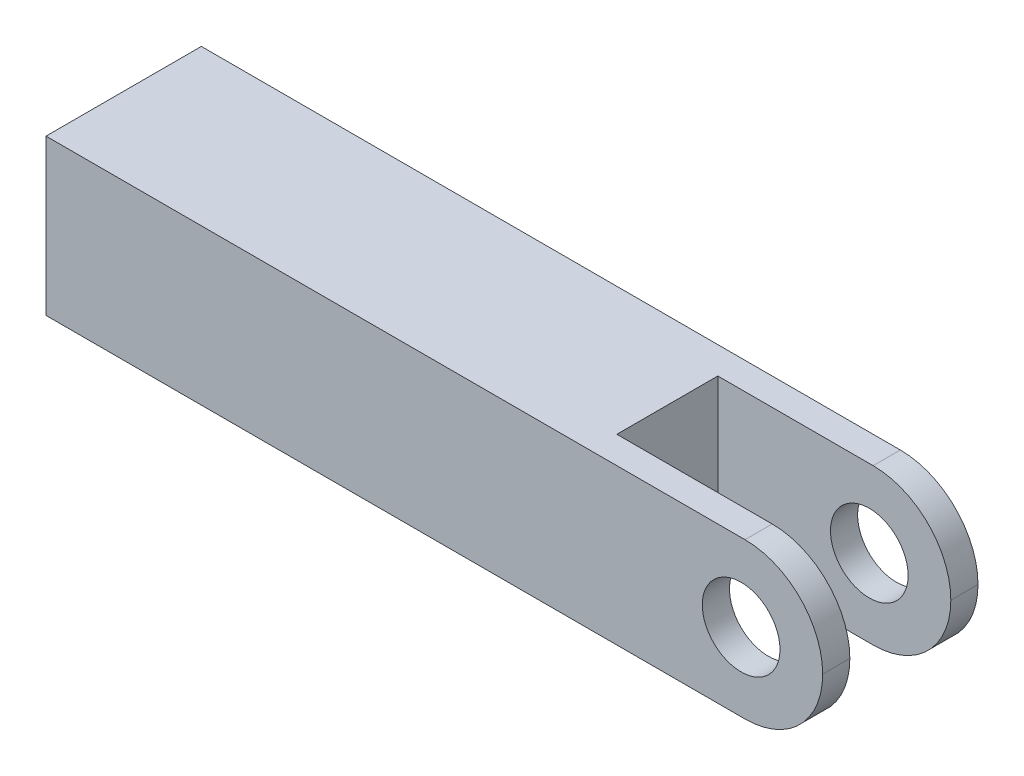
ISO-10303-21;
HEADER;
FILE_DESCRIPTION(('STEP AP214'),'2;1');
FILE_NAME('part.step','',(''),(''),'','','');
FILE_SCHEMA(('AUTOMOTIVE_DESIGN { 1 0 10303 214 1 1 1 1 }'));
ENDSEC;
DATA;
#1=APPLICATION_CONTEXT('core data for automotive mechanical design processes');
#2=APPLICATION_PROTOCOL_DEFINITION('international standard','automotive_design',2000,#1);
#3=PRODUCT_CONTEXT('',#1,'mechanical');
#4=PRODUCT('Part','Part','',(#3));
#5=PRODUCT_RELATED_PRODUCT_CATEGORY('part','',(#4));
#6=PRODUCT_DEFINITION_FORMATION('','',#4);
#7=PRODUCT_DEFINITION_CONTEXT('part definition',#1,'design');
#8=PRODUCT_DEFINITION('design','',#6,#7);
#9=PRODUCT_DEFINITION_SHAPE('','',#8);
#10=(LENGTH_UNIT() NAMED_UNIT(*) SI_UNIT(.MILLI.,.METRE.));
#11=(NAMED_UNIT(*) PLANE_ANGLE_UNIT() SI_UNIT($,.RADIAN.));
#12=(NAMED_UNIT(*) SI_UNIT($,.STERADIAN.) SOLID_ANGLE_UNIT());
#13=UNCERTAINTY_MEASURE_WITH_UNIT(LENGTH_MEASURE(1.E-05),#10,'distance_accuracy_value','');
#14=(GEOMETRIC_REPRESENTATION_CONTEXT(3) GLOBAL_UNCERTAINTY_ASSIGNED_CONTEXT((#13)) GLOBAL_UNIT_ASSIGNED_CONTEXT((#10,
#11,#12)) REPRESENTATION_CONTEXT('',''));
#15=CARTESIAN_POINT('',(0.,0.,0.));
#16=DIRECTION('',(0.,0.,1.));
#17=DIRECTION('',(1.,0.,0.));
#18=AXIS2_PLACEMENT_3D('',#15,#16,#17);
#19=CARTESIAN_POINT('',(79.9999999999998,0.,20.));
#20=DIRECTION('',(0.,0.,-0.999999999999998));
#21=DIRECTION('',(-0.999999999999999,0.,0.));
#22=AXIS2_PLACEMENT_3D('',#19,#20,#21);
#23=CYLINDRICAL_SURFACE('',#22,20.);
#24=CARTESIAN_POINT('',(79.9999999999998,0.,13.));
#25=DIRECTION('',(0.,0.,0.999999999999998));
#26=DIRECTION('',(0.999999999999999,0.,0.));
#27=AXIS2_PLACEMENT_3D('',#24,#25,#26);
#28=CIRCLE('',#27,20.);
#29=CARTESIAN_POINT('',(79.9999999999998,20.0000000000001,13.));
#30=VERTEX_POINT('',#29);
#31=CARTESIAN_POINT('',(99.9999999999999,0.,13.));
#32=VERTEX_POINT('',#31);
#33=EDGE_CURVE('E147',#30,#32,#28,.F.);
#34=ORIENTED_EDGE('',*,*,#33,.F.);
#35=DIRECTION('',(0.,0.,-0.999999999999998));
#36=VECTOR('',#35,1.);
#37=CARTESIAN_POINT('',(79.9999999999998,20.,20.));
#38=LINE('',#37,#36);
#39=CARTESIAN_POINT('',(79.9999999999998,20.,20.));
#40=VERTEX_POINT('',#39);
#41=EDGE_CURVE('E187',#40,#30,#38,.T.);
#42=ORIENTED_EDGE('',*,*,#41,.F.);
#43=CARTESIAN_POINT('',(79.9999999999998,0.,20.));
#44=DIRECTION('',(0.,0.,-0.999999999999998));
#45=DIRECTION('',(-0.999999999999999,0.,0.));
#46=AXIS2_PLACEMENT_3D('',#43,#44,#45);
#47=CIRCLE('',#46,20.);
#48=CARTESIAN_POINT('',(99.9999999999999,0.,20.));
#49=VERTEX_POINT('',#48);
#50=EDGE_CURVE('E60',#49,#40,#47,.F.);
#51=ORIENTED_EDGE('',*,*,#50,.F.);
#52=DIRECTION('',(0.,0.,-0.999999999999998));
#53=VECTOR('',#52,1.);
#54=CARTESIAN_POINT('',(99.9999999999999,0.,20.));
#55=LINE('',#54,#53);
#56=EDGE_CURVE('E149',#32,#49,#55,.F.);
#57=ORIENTED_EDGE('',*,*,#56,.F.);
#58=EDGE_LOOP('',(#34,#42,#51,#57));
#59=FACE_BOUND('',#58,.T.);
#60=ADVANCED_FACE('F36',(#59),#23,.T.);
#61=CARTESIAN_POINT('',(79.9999999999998,0.,20.));
#62=DIRECTION('',(0.,0.,-0.999999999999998));
#63=DIRECTION('',(-0.999999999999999,0.,0.));
#64=AXIS2_PLACEMENT_3D('',#61,#62,#63);
#65=CYLINDRICAL_SURFACE('',#64,20.);
#66=CARTESIAN_POINT('',(79.9999999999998,0.,13.));
#67=DIRECTION('',(0.,0.,0.999999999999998));
#68=DIRECTION('',(0.999999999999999,0.,0.));
#69=AXIS2_PLACEMENT_3D('',#66,#67,#68);
#70=CIRCLE('',#69,20.);
#71=CARTESIAN_POINT('',(79.9999999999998,-19.9999999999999,13.));
#72=VERTEX_POINT('',#71);
#73=EDGE_CURVE('E11',#32,#72,#70,.F.);
#74=ORIENTED_EDGE('',*,*,#73,.F.);
#75=ORIENTED_EDGE('',*,*,#56,.T.);
#76=CARTESIAN_POINT('',(79.9999999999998,0.,20.));
#77=DIRECTION('',(0.,0.,-0.999999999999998));
#78=DIRECTION('',(-0.999999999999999,0.,0.));
#79=AXIS2_PLACEMENT_3D('',#76,#77,#78);
#80=CIRCLE('',#79,20.);
#81=CARTESIAN_POINT('',(79.9999999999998,-20.,20.));
#82=VERTEX_POINT('',#81);
#83=EDGE_CURVE('E184',#82,#49,#80,.F.);
#84=ORIENTED_EDGE('',*,*,#83,.F.);
#85=DIRECTION('',(0.,0.,-0.999999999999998));
#86=VECTOR('',#85,1.);
#87=CARTESIAN_POINT('',(79.9999999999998,-20.,20.));
#88=LINE('',#87,#86);
#89=EDGE_CURVE('E179',#72,#82,#88,.F.);
#90=ORIENTED_EDGE('',*,*,#89,.F.);
#91=EDGE_LOOP('',(#74,#75,#84,#90));
#92=FACE_BOUND('',#91,.T.);
#93=ADVANCED_FACE('F219',(#92),#65,.T.);
#94=CARTESIAN_POINT('',(-99.9999999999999,-19.9999999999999,20.));
#95=DIRECTION('',(0.999999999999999,0.,0.));
#96=DIRECTION('',(0.,0.,-0.999999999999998));
#97=AXIS2_PLACEMENT_3D('',#94,#95,#96);
#98=PLANE('',#97);
#99=DIRECTION('',(0.,-0.999999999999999,0.));
#100=VECTOR('',#99,1.);
#101=CARTESIAN_POINT('',(-99.9999999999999,-19.9999999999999,-20.));
#102=LINE('',#101,#100);
#103=CARTESIAN_POINT('',(-99.9999999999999,20.,-20.));
#104=VERTEX_POINT('',#103);
#105=CARTESIAN_POINT('',(-99.9999999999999,-19.9999999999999,-20.));
#106=VERTEX_POINT('',#105);
#107=EDGE_CURVE('E153',#104,#106,#102,.T.);
#108=ORIENTED_EDGE('',*,*,#107,.T.);
#109=DIRECTION('',(0.,0.,-0.999999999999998));
#110=VECTOR('',#109,1.);
#111=CARTESIAN_POINT('',(-99.9999999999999,-19.9999999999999,20.));
#112=LINE('',#111,#110);
#113=CARTESIAN_POINT('',(-99.9999999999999,-19.9999999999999,20.));
#114=VERTEX_POINT('',#113);
#115=EDGE_CURVE('E172',#114,#106,#112,.T.);
#116=ORIENTED_EDGE('',*,*,#115,.F.);
#117=DIRECTION('',(0.,-0.999999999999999,0.));
#118=VECTOR('',#117,1.);
#119=CARTESIAN_POINT('',(-99.9999999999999,-19.9999999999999,20.));
#120=LINE('',#119,#118);
#121=CARTESIAN_POINT('',(-99.9999999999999,20.,20.));
#122=VERTEX_POINT('',#121);
#123=EDGE_CURVE('E161',#122,#114,#120,.T.);
#124=ORIENTED_EDGE('',*,*,#123,.F.);
#125=DIRECTION('',(0.,0.,-0.999999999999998));
#126=VECTOR('',#125,1.);
#127=CARTESIAN_POINT('',(-99.9999999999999,20.,20.));
#128=LINE('',#127,#126);
#129=EDGE_CURVE('E169',#122,#104,#128,.T.);
#130=ORIENTED_EDGE('',*,*,#129,.T.);
#131=EDGE_LOOP('',(#108,#116,#124,#130));
#132=FACE_BOUND('',#131,.T.);
#133=ADVANCED_FACE('F38',(#132),#98,.F.);
#134=CARTESIAN_POINT('',(-99.9999999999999,-19.9999999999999,20.));
#135=DIRECTION('',(0.,0.999999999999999,0.));
#136=DIRECTION('',(0.,0.,0.999999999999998));
#137=AXIS2_PLACEMENT_3D('',#134,#135,#136);
#138=PLANE('',#137);
#139=DIRECTION('',(0.,0.,0.999999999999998));
#140=VECTOR('',#139,1.);
#141=CARTESIAN_POINT('',(39.9999999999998,-20.,-13.));
#142=LINE('',#141,#140);
#143=CARTESIAN_POINT('',(39.9999999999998,-20.,-13.));
#144=VERTEX_POINT('',#143);
#145=CARTESIAN_POINT('',(39.9999999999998,-20.,13.));
#146=VERTEX_POINT('',#145);
#147=EDGE_CURVE('E130',#144,#146,#142,.T.);
#148=ORIENTED_EDGE('',*,*,#147,.T.);
#149=DIRECTION('',(0.999999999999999,0.,0.));
#150=VECTOR('',#149,1.);
#151=CARTESIAN_POINT('',(99.9999999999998,-19.9999999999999,13.));
#152=LINE('',#151,#150);
#153=EDGE_CURVE('E132',#146,#72,#152,.T.);
#154=ORIENTED_EDGE('',*,*,#153,.T.);
#155=ORIENTED_EDGE('',*,*,#89,.T.);
#156=DIRECTION('',(0.999999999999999,0.,0.));
#157=VECTOR('',#156,1.);
#158=CARTESIAN_POINT('',(-99.9999999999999,-19.9999999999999,20.));
#159=LINE('',#158,#157);
#160=EDGE_CURVE('E164',#114,#82,#159,.T.);
#161=ORIENTED_EDGE('',*,*,#160,.F.);
#162=ORIENTED_EDGE('',*,*,#115,.T.);
#163=DIRECTION('',(0.999999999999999,0.,0.));
#164=VECTOR('',#163,1.);
#165=CARTESIAN_POINT('',(-99.9999999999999,-19.9999999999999,-20.));
#166=LINE('',#165,#164);
#167=CARTESIAN_POINT('',(79.9999999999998,-19.9999999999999,-20.));
#168=VERTEX_POINT('',#167);
#169=EDGE_CURVE('E156',#106,#168,#166,.T.);
#170=ORIENTED_EDGE('',*,*,#169,.T.);
#171=CARTESIAN_POINT('',(79.9999999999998,-19.9999999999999,-13.));
#172=VERTEX_POINT('',#171);
#173=EDGE_CURVE('E180',#168,#172,#88,.F.);
#174=ORIENTED_EDGE('',*,*,#173,.T.);
#175=DIRECTION('',(-0.999999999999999,0.,0.));
#176=VECTOR('',#175,1.);
#177=CARTESIAN_POINT('',(99.9999999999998,-19.9999999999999,-13.));
#178=LINE('',#177,#176);
#179=EDGE_CURVE('E52',#172,#144,#178,.T.);
#180=ORIENTED_EDGE('',*,*,#179,.T.);
#181=EDGE_LOOP('',(#148,#154,#155,#161,#162,#170,#174,#180));
#182=FACE_BOUND('',#181,.T.);
#183=ADVANCED_FACE('F202',(#182),#138,.F.);
#184=CARTESIAN_POINT('',(-99.9999999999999,20.,20.));
#185=DIRECTION('',(0.,-0.999999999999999,0.));
#186=DIRECTION('',(0.,0.,-0.999999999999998));
#187=AXIS2_PLACEMENT_3D('',#184,#185,#186);
#188=PLANE('',#187);
#189=ORIENTED_EDGE('',*,*,#41,.T.);
#190=DIRECTION('',(0.999999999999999,0.,0.));
#191=VECTOR('',#190,1.);
#192=CARTESIAN_POINT('',(99.9999999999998,20.0000000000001,13.));
#193=LINE('',#192,#191);
#194=CARTESIAN_POINT('',(39.9999999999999,20.0000000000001,13.));
#195=VERTEX_POINT('',#194);
#196=EDGE_CURVE('E136',#195,#30,#193,.T.);
#197=ORIENTED_EDGE('',*,*,#196,.F.);
#198=DIRECTION('',(0.,0.,0.999999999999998));
#199=VECTOR('',#198,1.);
#200=CARTESIAN_POINT('',(39.9999999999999,20.0000000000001,-13.));
#201=LINE('',#200,#199);
#202=CARTESIAN_POINT('',(39.9999999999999,20.0000000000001,-13.));
#203=VERTEX_POINT('',#202);
#204=EDGE_CURVE('E122',#203,#195,#201,.T.);
#205=ORIENTED_EDGE('',*,*,#204,.F.);
#206=DIRECTION('',(-0.999999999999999,0.,0.));
#207=VECTOR('',#206,1.);
#208=CARTESIAN_POINT('',(99.9999999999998,20.0000000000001,-13.));
#209=LINE('',#208,#207);
#210=CARTESIAN_POINT('',(79.9999999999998,20.0000000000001,-13.));
#211=VERTEX_POINT('',#210);
#212=EDGE_CURVE('E112',#211,#203,#209,.T.);
#213=ORIENTED_EDGE('',*,*,#212,.F.);
#214=CARTESIAN_POINT('',(79.9999999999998,20.,-20.));
#215=VERTEX_POINT('',#214);
#216=EDGE_CURVE('E186',#211,#215,#38,.T.);
#217=ORIENTED_EDGE('',*,*,#216,.T.);
#218=DIRECTION('',(-0.999999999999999,0.,0.));
#219=VECTOR('',#218,1.);
#220=CARTESIAN_POINT('',(-99.9999999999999,20.,-20.));
#221=LINE('',#220,#219);
#222=EDGE_CURVE('E159',#215,#104,#221,.T.);
#223=ORIENTED_EDGE('',*,*,#222,.T.);
#224=ORIENTED_EDGE('',*,*,#129,.F.);
#225=DIRECTION('',(-0.999999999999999,0.,0.));
#226=VECTOR('',#225,1.);
#227=CARTESIAN_POINT('',(-99.9999999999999,20.,20.));
#228=LINE('',#227,#226);
#229=EDGE_CURVE('E167',#40,#122,#228,.T.);
#230=ORIENTED_EDGE('',*,*,#229,.F.);
#231=EDGE_LOOP('',(#189,#197,#205,#213,#217,#223,#224,#230));
#232=FACE_BOUND('',#231,.T.);
#233=ADVANCED_FACE('F135',(#232),#188,.F.);
#234=CARTESIAN_POINT('',(-99.9999999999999,20.,20.));
#235=DIRECTION('',(0.,0.,-0.999999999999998));
#236=DIRECTION('',(-0.999999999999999,0.,0.));
#237=AXIS2_PLACEMENT_3D('',#234,#235,#236);
#238=PLANE('',#237);
#239=CARTESIAN_POINT('',(79.0062178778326,0.,20.));
#240=DIRECTION('',(0.,0.,0.999999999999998));
#241=DIRECTION('',(0.999999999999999,0.,0.));
#242=AXIS2_PLACEMENT_3D('',#239,#240,#241);
#243=CIRCLE('',#242,9.99999999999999);
#244=CARTESIAN_POINT('',(89.0062178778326,0.,20.));
#245=VERTEX_POINT('',#244);
#246=EDGE_CURVE('E320',#245,#245,#243,.T.);
#247=ORIENTED_EDGE('',*,*,#246,.F.);
#248=EDGE_LOOP('',(#247));
#249=FACE_BOUND('',#248,.T.);
#250=ORIENTED_EDGE('',*,*,#160,.T.);
#251=ORIENTED_EDGE('',*,*,#83,.T.);
#252=ORIENTED_EDGE('',*,*,#50,.T.);
#253=ORIENTED_EDGE('',*,*,#229,.T.);
#254=ORIENTED_EDGE('',*,*,#123,.T.);
#255=EDGE_LOOP('',(#250,#251,#252,#253,#254));
#256=FACE_BOUND('',#255,.T.);
#257=ADVANCED_FACE('F208',(#249,#256),#238,.F.);
#258=CARTESIAN_POINT('',(-99.9999999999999,20.,-20.));
#259=DIRECTION('',(0.,0.,-0.999999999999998));
#260=DIRECTION('',(-0.999999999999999,0.,0.));
#261=AXIS2_PLACEMENT_3D('',#258,#259,#260);
#262=PLANE('',#261);
#263=CARTESIAN_POINT('',(79.0062178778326,0.,-20.));
#264=DIRECTION('',(0.,0.,0.999999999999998));
#265=DIRECTION('',(0.999999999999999,0.,0.));
#266=AXIS2_PLACEMENT_3D('',#263,#264,#265);
#267=CIRCLE('',#266,9.99999999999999);
#268=CARTESIAN_POINT('',(89.0062178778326,0.,-20.));
#269=VERTEX_POINT('',#268);
#270=EDGE_CURVE('E324',#269,#269,#267,.T.);
#271=ORIENTED_EDGE('',*,*,#270,.T.);
#272=EDGE_LOOP('',(#271));
#273=FACE_BOUND('',#272,.T.);
#274=CARTESIAN_POINT('',(79.9999999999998,0.,-20.));
#275=DIRECTION('',(0.,0.,-0.999999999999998));
#276=DIRECTION('',(-0.999999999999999,0.,0.));
#277=AXIS2_PLACEMENT_3D('',#274,#275,#276);
#278=CIRCLE('',#277,20.);
#279=CARTESIAN_POINT('',(99.9999999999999,1.11022302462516E-13,-20.));
#280=VERTEX_POINT('',#279);
#281=EDGE_CURVE('E175',#215,#280,#278,.T.);
#282=ORIENTED_EDGE('',*,*,#281,.T.);
#283=CARTESIAN_POINT('',(79.9999999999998,0.,-20.));
#284=DIRECTION('',(0.,0.,-0.999999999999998));
#285=DIRECTION('',(-0.999999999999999,0.,0.));
#286=AXIS2_PLACEMENT_3D('',#283,#284,#285);
#287=CIRCLE('',#286,20.);
#288=EDGE_CURVE('E177',#280,#168,#287,.T.);
#289=ORIENTED_EDGE('',*,*,#288,.T.);
#290=ORIENTED_EDGE('',*,*,#169,.F.);
#291=ORIENTED_EDGE('',*,*,#107,.F.);
#292=ORIENTED_EDGE('',*,*,#222,.F.);
#293=EDGE_LOOP('',(#282,#289,#290,#291,#292));
#294=FACE_BOUND('',#293,.T.);
#295=ADVANCED_FACE('F198',(#273,#294),#262,.T.);
#296=CARTESIAN_POINT('',(79.9999999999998,0.,-13.));
#297=DIRECTION('',(0.,0.,-0.999999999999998));
#298=DIRECTION('',(-0.999999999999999,0.,0.));
#299=AXIS2_PLACEMENT_3D('',#296,#297,#298);
#300=CIRCLE('',#299,20.);
#301=CARTESIAN_POINT('',(99.9999999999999,1.11022302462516E-13,-13.));
#302=VERTEX_POINT('',#301);
#303=EDGE_CURVE('E118',#302,#211,#300,.F.);
#304=ORIENTED_EDGE('',*,*,#303,.F.);
#305=EDGE_CURVE('E150',#280,#302,#55,.F.);
#306=ORIENTED_EDGE('',*,*,#305,.F.);
#307=ORIENTED_EDGE('',*,*,#281,.F.);
#308=ORIENTED_EDGE('',*,*,#216,.F.);
#309=EDGE_LOOP('',(#304,#306,#307,#308));
#310=FACE_BOUND('',#309,.T.);
#311=ADVANCED_FACE('F193',(#310),#23,.T.);
#312=CARTESIAN_POINT('',(79.9999999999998,0.,-13.));
#313=DIRECTION('',(0.,0.,-0.999999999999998));
#314=DIRECTION('',(-0.999999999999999,0.,0.));
#315=AXIS2_PLACEMENT_3D('',#312,#313,#314);
#316=CIRCLE('',#315,20.);
#317=EDGE_CURVE('E45',#172,#302,#316,.F.);
#318=ORIENTED_EDGE('',*,*,#317,.F.);
#319=ORIENTED_EDGE('',*,*,#173,.F.);
#320=ORIENTED_EDGE('',*,*,#288,.F.);
#321=ORIENTED_EDGE('',*,*,#305,.T.);
#322=EDGE_LOOP('',(#318,#319,#320,#321));
#323=FACE_BOUND('',#322,.T.);
#324=ADVANCED_FACE('F196',(#323),#65,.T.);
#325=CARTESIAN_POINT('',(99.9999999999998,-19.9999999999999,13.));
#326=DIRECTION('',(0.,0.,0.999999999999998));
#327=DIRECTION('',(0.999999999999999,0.,0.));
#328=AXIS2_PLACEMENT_3D('',#325,#326,#327);
#329=PLANE('',#328);
#330=CARTESIAN_POINT('',(79.0062178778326,0.,13.));
#331=DIRECTION('',(0.,0.,0.999999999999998));
#332=DIRECTION('',(0.999999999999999,0.,0.));
#333=AXIS2_PLACEMENT_3D('',#330,#331,#332);
#334=CIRCLE('',#333,9.99999999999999);
#335=CARTESIAN_POINT('',(89.0062178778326,0.,13.));
#336=VERTEX_POINT('',#335);
#337=EDGE_CURVE('E123',#336,#336,#334,.T.);
#338=ORIENTED_EDGE('',*,*,#337,.T.);
#339=EDGE_LOOP('',(#338));
#340=FACE_BOUND('',#339,.T.);
#341=ORIENTED_EDGE('',*,*,#33,.T.);
#342=ORIENTED_EDGE('',*,*,#73,.T.);
#343=ORIENTED_EDGE('',*,*,#153,.F.);
#344=DIRECTION('',(0.,0.999999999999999,0.));
#345=VECTOR('',#344,1.);
#346=CARTESIAN_POINT('',(39.9999999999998,-20.,13.));
#347=LINE('',#346,#345);
#348=EDGE_CURVE('E131',#146,#195,#347,.T.);
#349=ORIENTED_EDGE('',*,*,#348,.T.);
#350=ORIENTED_EDGE('',*,*,#196,.T.);
#351=EDGE_LOOP('',(#341,#342,#343,#349,#350));
#352=FACE_BOUND('',#351,.T.);
#353=ADVANCED_FACE('F217',(#340,#352),#329,.F.);
#354=CARTESIAN_POINT('',(39.9999999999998,-20.,-13.));
#355=DIRECTION('',(-0.999999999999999,0.,0.));
#356=DIRECTION('',(0.,0.,0.999999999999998));
#357=AXIS2_PLACEMENT_3D('',#354,#355,#356);
#358=PLANE('',#357);
#359=ORIENTED_EDGE('',*,*,#204,.T.);
#360=ORIENTED_EDGE('',*,*,#348,.F.);
#361=ORIENTED_EDGE('',*,*,#147,.F.);
#362=DIRECTION('',(0.,0.999999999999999,0.));
#363=VECTOR('',#362,1.);
#364=CARTESIAN_POINT('',(39.9999999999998,-20.,-13.));
#365=LINE('',#364,#363);
#366=EDGE_CURVE('E115',#144,#203,#365,.T.);
#367=ORIENTED_EDGE('',*,*,#366,.T.);
#368=EDGE_LOOP('',(#359,#360,#361,#367));
#369=FACE_BOUND('',#368,.T.);
#370=ADVANCED_FACE('F127',(#369),#358,.F.);
#371=CARTESIAN_POINT('',(99.9999999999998,-19.9999999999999,-13.));
#372=DIRECTION('',(0.,0.,-0.999999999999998));
#373=DIRECTION('',(-0.999999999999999,0.,0.));
#374=AXIS2_PLACEMENT_3D('',#371,#372,#373);
#375=PLANE('',#374);
#376=CARTESIAN_POINT('',(79.0062178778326,0.,-13.));
#377=DIRECTION('',(0.,0.,-0.999999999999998));
#378=DIRECTION('',(-0.999999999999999,0.,0.));
#379=AXIS2_PLACEMENT_3D('',#376,#377,#378);
#380=CIRCLE('',#379,9.99999999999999);
#381=CARTESIAN_POINT('',(89.0062178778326,0.,-13.));
#382=VERTEX_POINT('',#381);
#383=EDGE_CURVE('E40',#382,#382,#380,.T.);
#384=ORIENTED_EDGE('',*,*,#383,.T.);
#385=EDGE_LOOP('',(#384));
#386=FACE_BOUND('',#385,.T.);
#387=ORIENTED_EDGE('',*,*,#303,.T.);
#388=ORIENTED_EDGE('',*,*,#212,.T.);
#389=ORIENTED_EDGE('',*,*,#366,.F.);
#390=ORIENTED_EDGE('',*,*,#179,.F.);
#391=ORIENTED_EDGE('',*,*,#317,.T.);
#392=EDGE_LOOP('',(#387,#388,#389,#390,#391));
#393=FACE_BOUND('',#392,.T.);
#394=ADVANCED_FACE('F114',(#386,#393),#375,.F.);
#395=CARTESIAN_POINT('',(79.0062178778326,0.,-20.));
#396=DIRECTION('',(0.,0.,0.999999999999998));
#397=DIRECTION('',(0.999999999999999,0.,0.));
#398=AXIS2_PLACEMENT_3D('',#395,#396,#397);
#399=CYLINDRICAL_SURFACE('',#398,9.99999999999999);
#400=CARTESIAN_POINT('',(89.0062178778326,0.,-20.));
#401=CARTESIAN_POINT('',(89.0062178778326,0.,-19.9270833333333));
#402=CARTESIAN_POINT('',(89.0062178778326,0.,-19.8541666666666));
#403=CARTESIAN_POINT('',(89.0062178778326,0.,-19.7083333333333));
#404=CARTESIAN_POINT('',(89.0062178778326,0.,-19.6354166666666));
#405=CARTESIAN_POINT('',(89.0062178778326,0.,-19.4895833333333));
#406=CARTESIAN_POINT('',(89.0062178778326,0.,-19.4166666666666));
#407=CARTESIAN_POINT('',(89.0062178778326,0.,-19.2708333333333));
#408=CARTESIAN_POINT('',(89.0062178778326,0.,-19.1979166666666));
#409=CARTESIAN_POINT('',(89.0062178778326,0.,-19.0520833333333));
#410=CARTESIAN_POINT('',(89.0062178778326,0.,-18.9791666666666));
#411=CARTESIAN_POINT('',(89.0062178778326,0.,-18.8333333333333));
#412=CARTESIAN_POINT('',(89.0062178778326,0.,-18.7604166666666));
#413=CARTESIAN_POINT('',(89.0062178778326,0.,-18.6145833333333));
#414=CARTESIAN_POINT('',(89.0062178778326,0.,-18.5416666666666));
#415=CARTESIAN_POINT('',(89.0062178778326,0.,-18.3958333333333));
#416=CARTESIAN_POINT('',(89.0062178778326,0.,-18.3229166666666));
#417=CARTESIAN_POINT('',(89.0062178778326,0.,-18.1770833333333));
#418=CARTESIAN_POINT('',(89.0062178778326,0.,-18.1041666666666));
#419=CARTESIAN_POINT('',(89.0062178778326,0.,-17.9583333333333));
#420=CARTESIAN_POINT('',(89.0062178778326,0.,-17.8854166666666));
#421=CARTESIAN_POINT('',(89.0062178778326,0.,-17.7395833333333));
#422=CARTESIAN_POINT('',(89.0062178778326,0.,-17.6666666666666));
#423=CARTESIAN_POINT('',(89.0062178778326,0.,-17.5208333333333));
#424=CARTESIAN_POINT('',(89.0062178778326,0.,-17.4479166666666));
#425=CARTESIAN_POINT('',(89.0062178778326,0.,-17.3020833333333));
#426=CARTESIAN_POINT('',(89.0062178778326,0.,-17.2291666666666));
#427=CARTESIAN_POINT('',(89.0062178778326,0.,-17.0833333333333));
#428=CARTESIAN_POINT('',(89.0062178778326,0.,-17.0104166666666));
#429=CARTESIAN_POINT('',(89.0062178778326,0.,-16.8645833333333));
#430=CARTESIAN_POINT('',(89.0062178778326,0.,-16.7916666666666));
#431=CARTESIAN_POINT('',(89.0062178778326,0.,-16.6458333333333));
#432=CARTESIAN_POINT('',(89.0062178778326,0.,-16.5729166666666));
#433=CARTESIAN_POINT('',(89.0062178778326,0.,-16.4270833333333));
#434=CARTESIAN_POINT('',(89.0062178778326,0.,-16.3541666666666));
#435=CARTESIAN_POINT('',(89.0062178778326,0.,-16.2083333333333));
#436=CARTESIAN_POINT('',(89.0062178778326,0.,-16.1354166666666));
#437=CARTESIAN_POINT('',(89.0062178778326,0.,-15.9895833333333));
#438=CARTESIAN_POINT('',(89.0062178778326,0.,-15.9166666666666));
#439=CARTESIAN_POINT('',(89.0062178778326,0.,-15.7708333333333));
#440=CARTESIAN_POINT('',(89.0062178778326,0.,-15.6979166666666));
#441=CARTESIAN_POINT('',(89.0062178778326,0.,-15.5520833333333));
#442=CARTESIAN_POINT('',(89.0062178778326,0.,-15.4791666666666));
#443=CARTESIAN_POINT('',(89.0062178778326,0.,-15.3333333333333));
#444=CARTESIAN_POINT('',(89.0062178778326,0.,-15.2604166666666));
#445=CARTESIAN_POINT('',(89.0062178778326,0.,-15.1145833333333));
#446=CARTESIAN_POINT('',(89.0062178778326,0.,-15.0416666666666));
#447=CARTESIAN_POINT('',(89.0062178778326,0.,-14.8958333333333));
#448=CARTESIAN_POINT('',(89.0062178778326,0.,-14.8229166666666));
#449=CARTESIAN_POINT('',(89.0062178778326,0.,-14.6770833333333));
#450=CARTESIAN_POINT('',(89.0062178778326,0.,-14.6041666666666));
#451=CARTESIAN_POINT('',(89.0062178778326,0.,-14.4583333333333));
#452=CARTESIAN_POINT('',(89.0062178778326,0.,-14.3854166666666));
#453=CARTESIAN_POINT('',(89.0062178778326,0.,-14.2395833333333));
#454=CARTESIAN_POINT('',(89.0062178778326,0.,-14.1666666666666));
#455=CARTESIAN_POINT('',(89.0062178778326,0.,-14.0208333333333));
#456=CARTESIAN_POINT('',(89.0062178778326,0.,-13.9479166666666));
#457=CARTESIAN_POINT('',(89.0062178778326,0.,-13.8020833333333));
#458=CARTESIAN_POINT('',(89.0062178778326,0.,-13.7291666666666));
#459=CARTESIAN_POINT('',(89.0062178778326,0.,-13.5833333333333));
#460=CARTESIAN_POINT('',(89.0062178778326,0.,-13.5104166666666));
#461=CARTESIAN_POINT('',(89.0062178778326,0.,-13.3645833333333));
#462=CARTESIAN_POINT('',(89.0062178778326,0.,-13.2916666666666));
#463=CARTESIAN_POINT('',(89.0062178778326,0.,-13.1458333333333));
#464=CARTESIAN_POINT('',(89.0062178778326,0.,-13.0729166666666));
#465=CARTESIAN_POINT('',(89.0062178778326,0.,-13.));
#466=B_SPLINE_CURVE_WITH_KNOTS('',3,(#400,#401,#402,#403,#404,#405,#406,#407,#408,#409,#410,
#411,#412,#413,#414,#415,#416,#417,#418,#419,#420,#421,#422,#423,#424,#425,#426,#427,#428,#429,
#430,#431,#432,#433,#434,#435,#436,#437,#438,#439,#440,#441,#442,#443,#444,#445,#446,#447,#448,
#449,#450,#451,#452,#453,#454,#455,#456,#457,#458,#459,#460,#461,#462,#463,#464,#465),
.UNSPECIFIED.,.F.,.F.,(4,2,2,2,2,2,2,2,2,2,2,2,2,2,2,2,2,2,2,2,2,2,2,2,2,2,2,2,2,2,2,2,4),(0.,
0.218749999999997,0.437499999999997,0.656249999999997,0.874999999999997,1.09375,1.3125,1.53125,
1.75,1.96875,2.1875,2.40625,2.625,2.84375,3.0625,3.28125,3.5,3.71875,3.9375,4.15625,4.375,
4.59375,4.8125,5.03125,5.25,5.46875,5.6875,5.90625,6.125,6.34375,6.5625,6.78125,7.),.UNSPECIFIED.);
#467=EDGE_CURVE('BSEAM295',#269,#382,#466,.T.);
#468=ORIENTED_EDGE('',*,*,#270,.F.);
#469=ORIENTED_EDGE('',*,*,#383,.F.);
#470=ORIENTED_EDGE('',*,*,#467,.T.);
#471=ORIENTED_EDGE('',*,*,#467,.F.);
#472=EDGE_LOOP('',(#468,#470,#469,#471));
#473=FACE_BOUND('',#472,.T.);
#474=ADVANCED_FACE('F295',(#473),#399,.F.);
#475=CARTESIAN_POINT('',(89.0062178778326,0.,20.));
#476=CARTESIAN_POINT('',(89.0062178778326,0.,19.9270833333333));
#477=CARTESIAN_POINT('',(89.0062178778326,0.,19.8541666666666));
#478=CARTESIAN_POINT('',(89.0062178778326,0.,19.7083333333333));
#479=CARTESIAN_POINT('',(89.0062178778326,0.,19.6354166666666));
#480=CARTESIAN_POINT('',(89.0062178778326,0.,19.4895833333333));
#481=CARTESIAN_POINT('',(89.0062178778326,0.,19.4166666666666));
#482=CARTESIAN_POINT('',(89.0062178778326,0.,19.2708333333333));
#483=CARTESIAN_POINT('',(89.0062178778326,0.,19.1979166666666));
#484=CARTESIAN_POINT('',(89.0062178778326,0.,19.0520833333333));
#485=CARTESIAN_POINT('',(89.0062178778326,0.,18.9791666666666));
#486=CARTESIAN_POINT('',(89.0062178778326,0.,18.8333333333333));
#487=CARTESIAN_POINT('',(89.0062178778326,0.,18.7604166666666));
#488=CARTESIAN_POINT('',(89.0062178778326,0.,18.6145833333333));
#489=CARTESIAN_POINT('',(89.0062178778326,0.,18.5416666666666));
#490=CARTESIAN_POINT('',(89.0062178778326,0.,18.3958333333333));
#491=CARTESIAN_POINT('',(89.0062178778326,0.,18.3229166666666));
#492=CARTESIAN_POINT('',(89.0062178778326,0.,18.1770833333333));
#493=CARTESIAN_POINT('',(89.0062178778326,0.,18.1041666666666));
#494=CARTESIAN_POINT('',(89.0062178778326,0.,17.9583333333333));
#495=CARTESIAN_POINT('',(89.0062178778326,0.,17.8854166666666));
#496=CARTESIAN_POINT('',(89.0062178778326,0.,17.7395833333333));
#497=CARTESIAN_POINT('',(89.0062178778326,0.,17.6666666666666));
#498=CARTESIAN_POINT('',(89.0062178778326,0.,17.5208333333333));
#499=CARTESIAN_POINT('',(89.0062178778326,0.,17.4479166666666));
#500=CARTESIAN_POINT('',(89.0062178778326,0.,17.3020833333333));
#501=CARTESIAN_POINT('',(89.0062178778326,0.,17.2291666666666));
#502=CARTESIAN_POINT('',(89.0062178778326,0.,17.0833333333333));
#503=CARTESIAN_POINT('',(89.0062178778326,0.,17.0104166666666));
#504=CARTESIAN_POINT('',(89.0062178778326,0.,16.8645833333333));
#505=CARTESIAN_POINT('',(89.0062178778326,0.,16.7916666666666));
#506=CARTESIAN_POINT('',(89.0062178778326,0.,16.6458333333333));
#507=CARTESIAN_POINT('',(89.0062178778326,0.,16.5729166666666));
#508=CARTESIAN_POINT('',(89.0062178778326,0.,16.4270833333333));
#509=CARTESIAN_POINT('',(89.0062178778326,0.,16.3541666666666));
#510=CARTESIAN_POINT('',(89.0062178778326,0.,16.2083333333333));
#511=CARTESIAN_POINT('',(89.0062178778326,0.,16.1354166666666));
#512=CARTESIAN_POINT('',(89.0062178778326,0.,15.9895833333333));
#513=CARTESIAN_POINT('',(89.0062178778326,0.,15.9166666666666));
#514=CARTESIAN_POINT('',(89.0062178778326,0.,15.7708333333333));
#515=CARTESIAN_POINT('',(89.0062178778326,0.,15.6979166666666));
#516=CARTESIAN_POINT('',(89.0062178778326,0.,15.5520833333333));
#517=CARTESIAN_POINT('',(89.0062178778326,0.,15.4791666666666));
#518=CARTESIAN_POINT('',(89.0062178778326,0.,15.3333333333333));
#519=CARTESIAN_POINT('',(89.0062178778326,0.,15.2604166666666));
#520=CARTESIAN_POINT('',(89.0062178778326,0.,15.1145833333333));
#521=CARTESIAN_POINT('',(89.0062178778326,0.,15.0416666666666));
#522=CARTESIAN_POINT('',(89.0062178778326,0.,14.8958333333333));
#523=CARTESIAN_POINT('',(89.0062178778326,0.,14.8229166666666));
#524=CARTESIAN_POINT('',(89.0062178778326,0.,14.6770833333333));
#525=CARTESIAN_POINT('',(89.0062178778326,0.,14.6041666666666));
#526=CARTESIAN_POINT('',(89.0062178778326,0.,14.4583333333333));
#527=CARTESIAN_POINT('',(89.0062178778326,0.,14.3854166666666));
#528=CARTESIAN_POINT('',(89.0062178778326,0.,14.2395833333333));
#529=CARTESIAN_POINT('',(89.0062178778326,0.,14.1666666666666));
#530=CARTESIAN_POINT('',(89.0062178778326,0.,14.0208333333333));
#531=CARTESIAN_POINT('',(89.0062178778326,0.,13.9479166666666));
#532=CARTESIAN_POINT('',(89.0062178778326,0.,13.8020833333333));
#533=CARTESIAN_POINT('',(89.0062178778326,0.,13.7291666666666));
#534=CARTESIAN_POINT('',(89.0062178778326,0.,13.5833333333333));
#535=CARTESIAN_POINT('',(89.0062178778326,0.,13.5104166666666));
#536=CARTESIAN_POINT('',(89.0062178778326,0.,13.3645833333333));
#537=CARTESIAN_POINT('',(89.0062178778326,0.,13.2916666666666));
#538=CARTESIAN_POINT('',(89.0062178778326,0.,13.1458333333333));
#539=CARTESIAN_POINT('',(89.0062178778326,0.,13.0729166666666));
#540=CARTESIAN_POINT('',(89.0062178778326,0.,13.));
#541=B_SPLINE_CURVE_WITH_KNOTS('',3,(#475,#476,#477,#478,#479,#480,#481,#482,#483,#484,#485,
#486,#487,#488,#489,#490,#491,#492,#493,#494,#495,#496,#497,#498,#499,#500,#501,#502,#503,#504,
#505,#506,#507,#508,#509,#510,#511,#512,#513,#514,#515,#516,#517,#518,#519,#520,#521,#522,#523,
#524,#525,#526,#527,#528,#529,#530,#531,#532,#533,#534,#535,#536,#537,#538,#539,#540),
.UNSPECIFIED.,.F.,.F.,(4,2,2,2,2,2,2,2,2,2,2,2,2,2,2,2,2,2,2,2,2,2,2,2,2,2,2,2,2,2,2,2,4),(0.,
0.218750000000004,0.4375,0.656250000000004,0.875000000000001,1.09375,1.3125,1.53125,1.75,
1.96875000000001,2.18750000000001,2.40625000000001,2.62500000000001,2.84375000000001,3.0625,
3.28125,3.5,3.71875000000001,3.9375,4.15625000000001,4.375,4.59375000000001,4.8125,
5.03125000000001,5.25000000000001,5.46875000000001,5.68750000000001,5.90625000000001,
6.12500000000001,6.34375000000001,6.56250000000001,6.78125000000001,7.00000000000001),.UNSPECIFIED.);
#542=EDGE_CURVE('BSEAM304',#245,#336,#541,.T.);
#543=ORIENTED_EDGE('',*,*,#246,.T.);
#544=ORIENTED_EDGE('',*,*,#337,.F.);
#545=ORIENTED_EDGE('',*,*,#542,.T.);
#546=ORIENTED_EDGE('',*,*,#542,.F.);
#547=EDGE_LOOP('',(#543,#545,#544,#546));
#548=FACE_BOUND('',#547,.T.);
#549=ADVANCED_FACE('F304',(#548),#399,.F.);
#550=CLOSED_SHELL('',(#60,#93,#133,#183,#233,#257,#295,#311,#324,#353,#370,#394,#474,#549));
#551=MANIFOLD_SOLID_BREP('B2',#550);
#552=ADVANCED_BREP_SHAPE_REPRESENTATION('',(#18,#551),#14);
#553=SHAPE_DEFINITION_REPRESENTATION(#9,#552);
ENDSEC;
END-ISO-10303-21;
